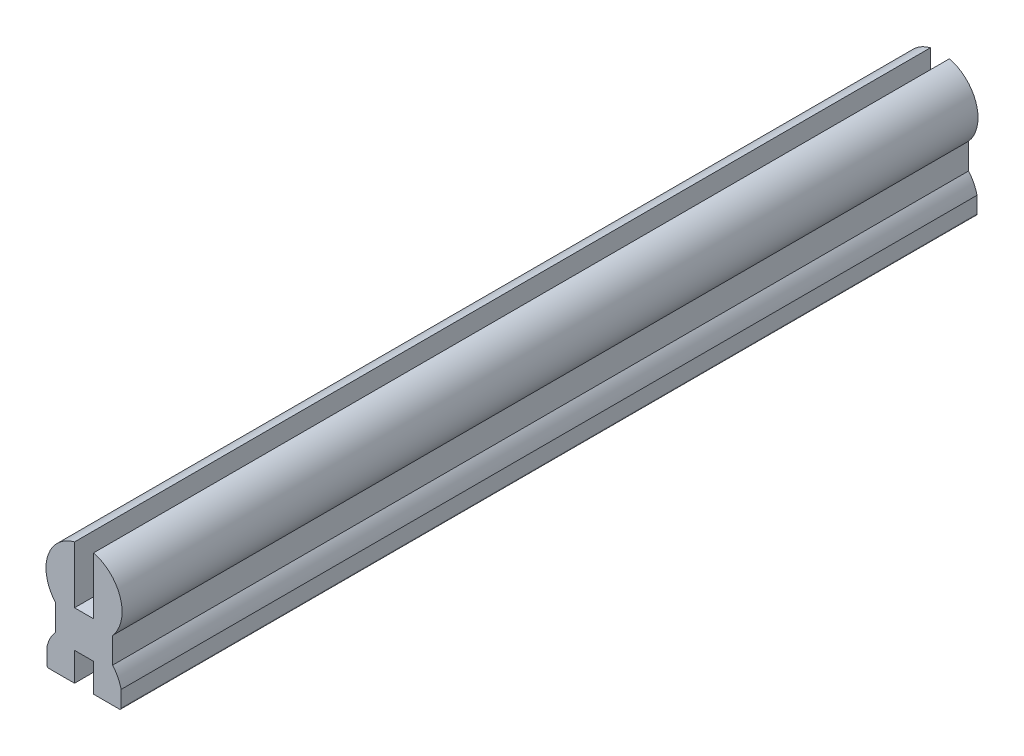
from build123d import *

# Parameters (mm, degrees)
EXTRUDE_1_DEPTH = 45
FILLET_1_R      = 0.1


with BuildPart() as part:
    # Sketch 1 → Extrude 1 (new body)
    with BuildSketch(Plane.XY):
        with BuildLine():
            Line((-1.95, -2.5), (-0.5, -2.5))
            Line((-0.5, -2.5), (-0.5, -1))
            Line((-0.5, -1), (0.5, -1))
            Line((0.5, -1), (0.5, -2.5))
            Line((0.5, -2.5), (1.95, -2.5))
            Line((1.95, -2.5), (1.95, -1.555590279))
            ThreePointArc((1.95, -1.555590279), (1.780042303, -1.088161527), (1.5, -0.677124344))
            Line((1.5, -0.677124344), (1.5, 0.677124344))
            ThreePointArc((1.5, 0.677124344), (1.912032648, 2.586626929), (0.5, 3.936491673))
            Line((0.5, 3.936491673), (0.5, 0.936491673))
            Line((0.5, 0.936491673), (-0.5, 0.936491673))
            Line((-0.5, 0.936491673), (-0.5, 3.936491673))
            ThreePointArc((-0.5, 3.936491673), (-1.912032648, 2.586626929), (-1.5, 0.677124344))
            Line((-1.5, 0.677124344), (-1.5, -0.677124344))
            ThreePointArc((-1.5, -0.677124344), (-1.780042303, -1.088161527), (-1.95, -1.555590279))
            Line((-1.95, -1.555590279), (-1.95, -2.5))
        make_face()
    extrude(amount=-EXTRUDE_1_DEPTH)

    # Fillet 1
    fillet_1_edges = [part.edges().sort_by_distance(p)[0] for p in [
        (1.95, -2.5, -22.5),
        (-1.95, -2.5, -22.5),
    ]]
    fillet(fillet_1_edges, radius=FILLET_1_R)


solid = part.part
